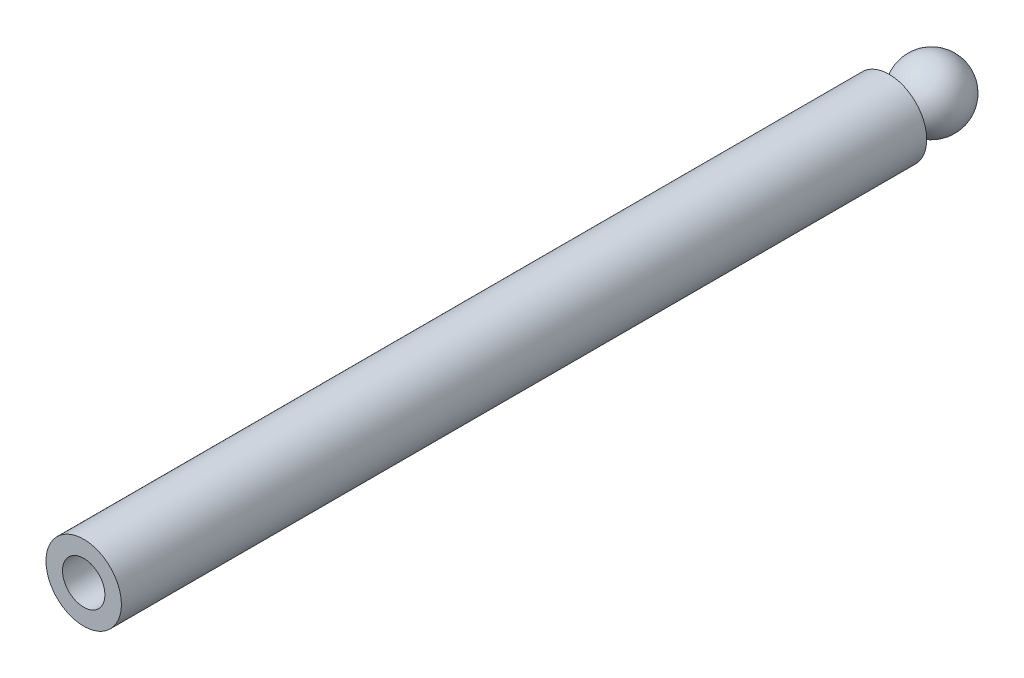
ISO-10303-21;
HEADER;
FILE_DESCRIPTION(('STEP AP214'),'2;1');
FILE_NAME('part.step','',(''),(''),'','','');
FILE_SCHEMA(('AUTOMOTIVE_DESIGN { 1 0 10303 214 1 1 1 1 }'));
ENDSEC;
DATA;
#1=APPLICATION_CONTEXT('core data for automotive mechanical design processes');
#2=APPLICATION_PROTOCOL_DEFINITION('international standard','automotive_design',2000,#1);
#3=PRODUCT_CONTEXT('',#1,'mechanical');
#4=PRODUCT('Part','Part','',(#3));
#5=PRODUCT_RELATED_PRODUCT_CATEGORY('part','',(#4));
#6=PRODUCT_DEFINITION_FORMATION('','',#4);
#7=PRODUCT_DEFINITION_CONTEXT('part definition',#1,'design');
#8=PRODUCT_DEFINITION('design','',#6,#7);
#9=PRODUCT_DEFINITION_SHAPE('','',#8);
#10=(LENGTH_UNIT() NAMED_UNIT(*) SI_UNIT(.MILLI.,.METRE.));
#11=(NAMED_UNIT(*) PLANE_ANGLE_UNIT() SI_UNIT($,.RADIAN.));
#12=(NAMED_UNIT(*) SI_UNIT($,.STERADIAN.) SOLID_ANGLE_UNIT());
#13=UNCERTAINTY_MEASURE_WITH_UNIT(LENGTH_MEASURE(1.E-05),#10,'distance_accuracy_value','');
#14=(GEOMETRIC_REPRESENTATION_CONTEXT(3) GLOBAL_UNCERTAINTY_ASSIGNED_CONTEXT((#13)) GLOBAL_UNIT_ASSIGNED_CONTEXT((#10,
#11,#12)) REPRESENTATION_CONTEXT('',''));
#15=CARTESIAN_POINT('',(0.,0.,0.));
#16=DIRECTION('',(0.,0.,1.));
#17=DIRECTION('',(1.,0.,0.));
#18=AXIS2_PLACEMENT_3D('',#15,#16,#17);
#19=CARTESIAN_POINT('',(0.,0.,0.));
#20=DIRECTION('',(0.,1.,0.));
#21=DIRECTION('',(1.,0.,0.));
#22=AXIS2_PLACEMENT_3D('',#19,#20,#21);
#23=SPHERICAL_SURFACE('',#22,35.);
#24=CARTESIAN_POINT('',(0.,0.,0.));
#25=DIRECTION('',(0.,0.,-1.));
#26=DIRECTION('',(-1.,0.,0.));
#27=AXIS2_PLACEMENT_3D('',#24,#25,#26);
#28=SPHERICAL_SURFACE('',#27,35.);
#29=CARTESIAN_POINT('',(0.,0.,33.5410196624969));
#30=DIRECTION('',(0.,0.,-1.));
#31=DIRECTION('',(-1.,0.,0.));
#32=AXIS2_PLACEMENT_3D('',#29,#30,#31);
#33=CIRCLE('',#32,10.);
#34=CARTESIAN_POINT('',(-10.,0.,33.5410196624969));
#35=VERTEX_POINT('',#34);
#36=EDGE_CURVE('E10',#35,#35,#33,.F.);
#37=ORIENTED_EDGE('',*,*,#36,.F.);
#38=EDGE_LOOP('',(#37));
#39=FACE_BOUND('',#38,.T.);
#40=ADVANCED_FACE('F31',(#39),#28,.T.);
#41=CARTESIAN_POINT('',(0.,0.,45.));
#42=DIRECTION('',(0.,0.,-1.));
#43=DIRECTION('',(-1.,0.,0.));
#44=AXIS2_PLACEMENT_3D('',#41,#42,#43);
#45=CYLINDRICAL_SURFACE('',#44,10.);
#46=CARTESIAN_POINT('',(0.,0.,45.));
#47=DIRECTION('',(0.,0.,1.));
#48=DIRECTION('',(1.,0.,0.));
#49=AXIS2_PLACEMENT_3D('',#46,#47,#48);
#50=CIRCLE('',#49,10.);
#51=CARTESIAN_POINT('',(-10.,0.,45.));
#52=VERTEX_POINT('',#51);
#53=EDGE_CURVE('E37',#52,#52,#50,.T.);
#54=CARTESIAN_POINT('',(-10.,0.,45.));
#55=CARTESIAN_POINT('',(-10.,0.,44.8806356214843));
#56=CARTESIAN_POINT('',(-10.,0.,44.7612712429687));
#57=CARTESIAN_POINT('',(-10.,0.,44.5225424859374));
#58=CARTESIAN_POINT('',(-10.,0.,44.4031781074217));
#59=CARTESIAN_POINT('',(-10.,0.,44.1644493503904));
#60=CARTESIAN_POINT('',(-10.,0.,44.0450849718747));
#61=CARTESIAN_POINT('',(-10.,0.,43.8063562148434));
#62=CARTESIAN_POINT('',(-10.,0.,43.6869918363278));
#63=CARTESIAN_POINT('',(-10.,0.,43.4482630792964));
#64=CARTESIAN_POINT('',(-10.,0.,43.3288987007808));
#65=CARTESIAN_POINT('',(-10.,0.,43.0901699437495));
#66=CARTESIAN_POINT('',(-10.,0.,42.9708055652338));
#67=CARTESIAN_POINT('',(-10.,0.,42.7320768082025));
#68=CARTESIAN_POINT('',(-10.,0.,42.6127124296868));
#69=CARTESIAN_POINT('',(-10.,0.,42.3739836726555));
#70=CARTESIAN_POINT('',(-10.,0.,42.2546192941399));
#71=CARTESIAN_POINT('',(-10.,0.,42.0158905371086));
#72=CARTESIAN_POINT('',(-10.,0.,41.8965261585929));
#73=CARTESIAN_POINT('',(-10.,0.,41.6577974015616));
#74=CARTESIAN_POINT('',(-10.,0.,41.5384330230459));
#75=CARTESIAN_POINT('',(-10.,0.,41.2997042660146));
#76=CARTESIAN_POINT('',(-10.,0.,41.180339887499));
#77=CARTESIAN_POINT('',(-10.,0.,40.9416111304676));
#78=CARTESIAN_POINT('',(-10.,0.,40.822246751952));
#79=CARTESIAN_POINT('',(-10.,0.,40.5835179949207));
#80=CARTESIAN_POINT('',(-10.,0.,40.464153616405));
#81=CARTESIAN_POINT('',(-10.,0.,40.2254248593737));
#82=CARTESIAN_POINT('',(-10.,0.,40.106060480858));
#83=CARTESIAN_POINT('',(-10.,0.,39.8673317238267));
#84=CARTESIAN_POINT('',(-10.,0.,39.7479673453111));
#85=CARTESIAN_POINT('',(-10.,0.,39.5092385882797));
#86=CARTESIAN_POINT('',(-10.,0.,39.3898742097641));
#87=CARTESIAN_POINT('',(-10.,0.,39.1511454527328));
#88=CARTESIAN_POINT('',(-10.,0.,39.0317810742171));
#89=CARTESIAN_POINT('',(-10.,0.,38.7930523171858));
#90=CARTESIAN_POINT('',(-10.,0.,38.6736879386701));
#91=CARTESIAN_POINT('',(-10.,0.,38.4349591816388));
#92=CARTESIAN_POINT('',(-10.,0.,38.3155948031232));
#93=CARTESIAN_POINT('',(-10.,0.,38.0768660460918));
#94=CARTESIAN_POINT('',(-10.,0.,37.9575016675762));
#95=CARTESIAN_POINT('',(-10.,0.,37.7187729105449));
#96=CARTESIAN_POINT('',(-10.,0.,37.5994085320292));
#97=CARTESIAN_POINT('',(-10.,0.,37.3606797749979));
#98=CARTESIAN_POINT('',(-10.,0.,37.2413153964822));
#99=CARTESIAN_POINT('',(-10.,0.,37.0025866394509));
#100=CARTESIAN_POINT('',(-10.,0.,36.8832222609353));
#101=CARTESIAN_POINT('',(-10.,0.,36.644493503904));
#102=CARTESIAN_POINT('',(-10.,0.,36.5251291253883));
#103=CARTESIAN_POINT('',(-10.,0.,36.286400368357));
#104=CARTESIAN_POINT('',(-10.,0.,36.1670359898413));
#105=CARTESIAN_POINT('',(-10.,0.,35.92830723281));
#106=CARTESIAN_POINT('',(-10.,0.,35.8089428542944));
#107=CARTESIAN_POINT('',(-10.,0.,35.570214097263));
#108=CARTESIAN_POINT('',(-10.,0.,35.4508497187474));
#109=CARTESIAN_POINT('',(-10.,0.,35.2121209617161));
#110=CARTESIAN_POINT('',(-10.,0.,35.0927565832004));
#111=CARTESIAN_POINT('',(-10.,0.,34.8540278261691));
#112=CARTESIAN_POINT('',(-10.,0.,34.7346634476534));
#113=CARTESIAN_POINT('',(-10.,0.,34.4959346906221));
#114=CARTESIAN_POINT('',(-10.,0.,34.3765703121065));
#115=CARTESIAN_POINT('',(-10.,0.,34.1378415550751));
#116=CARTESIAN_POINT('',(-10.,0.,34.0184771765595));
#117=CARTESIAN_POINT('',(-10.,0.,33.7797484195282));
#118=CARTESIAN_POINT('',(-10.,0.,33.6603840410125));
#119=CARTESIAN_POINT('',(-10.,0.,33.5410196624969));
#120=B_SPLINE_CURVE_WITH_KNOTS('',3,(#54,#55,#56,#57,#58,#59,#60,#61,#62,#63,#64,#65,#66,#67,
#68,#69,#70,#71,#72,#73,#74,#75,#76,#77,#78,#79,#80,#81,#82,#83,#84,#85,#86,#87,#88,#89,#90,#91,
#92,#93,#94,#95,#96,#97,#98,#99,#100,#101,#102,#103,#104,#105,#106,#107,#108,#109,#110,#111,
#112,#113,#114,#115,#116,#117,#118,#119),.UNSPECIFIED.,.F.,.F.,(4,2,2,2,2,2,2,2,2,2,2,2,2,2,2,2,
2,2,2,2,2,2,2,2,2,2,2,2,2,2,2,2,4),(0.,0.358093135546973,0.716186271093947,1.07427940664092,
1.43237254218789,1.79046567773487,2.14855881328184,2.50665194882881,2.86474508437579,
3.22283821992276,3.58093135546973,3.93902449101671,4.29711762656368,4.65521076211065,
5.01330389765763,5.3713970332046,5.72949016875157,6.08758330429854,6.44567643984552,
6.80376957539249,7.16186271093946,7.51995584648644,7.87804898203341,8.23614211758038,
8.59423525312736,8.95232838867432,9.3104215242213,9.66851465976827,10.0266077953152,
10.3847009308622,10.7427940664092,11.1008872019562,11.4589803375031),.UNSPECIFIED.);
#121=EDGE_CURVE('BSEAM79',#52,#35,#120,.T.);
#122=ORIENTED_EDGE('',*,*,#53,.F.);
#123=ORIENTED_EDGE('',*,*,#36,.T.);
#124=ORIENTED_EDGE('',*,*,#121,.T.);
#125=ORIENTED_EDGE('',*,*,#121,.F.);
#126=EDGE_LOOP('',(#122,#124,#123,#125));
#127=FACE_BOUND('',#126,.T.);
#128=ADVANCED_FACE('F79',(#127),#45,.T.);
#129=CARTESIAN_POINT('',(0.,0.,45.));
#130=DIRECTION('',(0.,0.,1.));
#131=DIRECTION('',(1.,0.,0.));
#132=AXIS2_PLACEMENT_3D('',#129,#130,#131);
#133=PLANE('',#132);
#134=CARTESIAN_POINT('',(0.,0.,45.));
#135=DIRECTION('',(0.,0.,1.));
#136=DIRECTION('',(1.,0.,0.));
#137=AXIS2_PLACEMENT_3D('',#134,#135,#136);
#138=CIRCLE('',#137,40.);
#139=CARTESIAN_POINT('',(-40.,0.,44.9999999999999));
#140=VERTEX_POINT('',#139);
#141=EDGE_CURVE('E45',#140,#140,#138,.T.);
#142=ORIENTED_EDGE('',*,*,#141,.F.);
#143=EDGE_LOOP('',(#142));
#144=FACE_BOUND('',#143,.T.);
#145=ORIENTED_EDGE('',*,*,#53,.T.);
#146=EDGE_LOOP('',(#145));
#147=FACE_BOUND('',#146,.T.);
#148=ADVANCED_FACE('F74',(#144,#147),#133,.F.);
#149=CARTESIAN_POINT('',(0.,0.,900.));
#150=DIRECTION('',(0.,0.,-1.));
#151=DIRECTION('',(-1.,0.,0.));
#152=AXIS2_PLACEMENT_3D('',#149,#150,#151);
#153=CYLINDRICAL_SURFACE('',#152,40.);
#154=CARTESIAN_POINT('',(0.,0.,900.));
#155=DIRECTION('',(0.,0.,1.));
#156=DIRECTION('',(1.,0.,0.));
#157=AXIS2_PLACEMENT_3D('',#154,#155,#156);
#158=CIRCLE('',#157,40.);
#159=CARTESIAN_POINT('',(-40.,0.,900.));
#160=VERTEX_POINT('',#159);
#161=EDGE_CURVE('E41',#160,#160,#158,.T.);
#162=CARTESIAN_POINT('',(-40.,0.,900.));
#163=CARTESIAN_POINT('',(-40.,0.,891.09375));
#164=CARTESIAN_POINT('',(-40.,0.,882.1875));
#165=CARTESIAN_POINT('',(-40.,0.,864.375));
#166=CARTESIAN_POINT('',(-40.,0.,855.46875));
#167=CARTESIAN_POINT('',(-40.,0.,837.65625));
#168=CARTESIAN_POINT('',(-40.,0.,828.75));
#169=CARTESIAN_POINT('',(-40.,0.,810.9375));
#170=CARTESIAN_POINT('',(-40.,0.,802.03125));
#171=CARTESIAN_POINT('',(-40.,0.,784.21875));
#172=CARTESIAN_POINT('',(-40.,0.,775.3125));
#173=CARTESIAN_POINT('',(-40.,0.,757.5));
#174=CARTESIAN_POINT('',(-40.,0.,748.59375));
#175=CARTESIAN_POINT('',(-40.,0.,730.78125));
#176=CARTESIAN_POINT('',(-40.,0.,721.875));
#177=CARTESIAN_POINT('',(-40.,0.,704.0625));
#178=CARTESIAN_POINT('',(-40.,0.,695.15625));
#179=CARTESIAN_POINT('',(-40.,0.,677.34375));
#180=CARTESIAN_POINT('',(-40.,0.,668.4375));
#181=CARTESIAN_POINT('',(-40.,0.,650.625));
#182=CARTESIAN_POINT('',(-40.,0.,641.71875));
#183=CARTESIAN_POINT('',(-40.,0.,623.90625));
#184=CARTESIAN_POINT('',(-40.,0.,615.));
#185=CARTESIAN_POINT('',(-40.,0.,597.1875));
#186=CARTESIAN_POINT('',(-40.,0.,588.28125));
#187=CARTESIAN_POINT('',(-40.,0.,570.46875));
#188=CARTESIAN_POINT('',(-40.,0.,561.5625));
#189=CARTESIAN_POINT('',(-40.,0.,543.75));
#190=CARTESIAN_POINT('',(-40.,0.,534.84375));
#191=CARTESIAN_POINT('',(-40.,0.,517.03125));
#192=CARTESIAN_POINT('',(-40.,0.,508.125));
#193=CARTESIAN_POINT('',(-40.,0.,490.3125));
#194=CARTESIAN_POINT('',(-40.,0.,481.40625));
#195=CARTESIAN_POINT('',(-40.,0.,463.59375));
#196=CARTESIAN_POINT('',(-40.,0.,454.6875));
#197=CARTESIAN_POINT('',(-40.,0.,436.875));
#198=CARTESIAN_POINT('',(-40.,0.,427.96875));
#199=CARTESIAN_POINT('',(-40.,0.,410.15625));
#200=CARTESIAN_POINT('',(-40.,0.,401.25));
#201=CARTESIAN_POINT('',(-40.,0.,383.4375));
#202=CARTESIAN_POINT('',(-40.,0.,374.53125));
#203=CARTESIAN_POINT('',(-40.,0.,356.71875));
#204=CARTESIAN_POINT('',(-40.,0.,347.8125));
#205=CARTESIAN_POINT('',(-40.,0.,330.));
#206=CARTESIAN_POINT('',(-40.,0.,321.09375));
#207=CARTESIAN_POINT('',(-40.,0.,303.28125));
#208=CARTESIAN_POINT('',(-40.,0.,294.375));
#209=CARTESIAN_POINT('',(-40.,0.,276.5625));
#210=CARTESIAN_POINT('',(-40.,0.,267.65625));
#211=CARTESIAN_POINT('',(-40.,0.,249.84375));
#212=CARTESIAN_POINT('',(-40.,0.,240.9375));
#213=CARTESIAN_POINT('',(-40.,0.,223.125));
#214=CARTESIAN_POINT('',(-40.,0.,214.21875));
#215=CARTESIAN_POINT('',(-40.,0.,196.40625));
#216=CARTESIAN_POINT('',(-40.,0.,187.5));
#217=CARTESIAN_POINT('',(-40.,0.,169.6875));
#218=CARTESIAN_POINT('',(-40.,0.,160.78125));
#219=CARTESIAN_POINT('',(-40.,0.,142.96875));
#220=CARTESIAN_POINT('',(-40.,0.,134.0625));
#221=CARTESIAN_POINT('',(-40.,0.,116.25));
#222=CARTESIAN_POINT('',(-40.,0.,107.34375));
#223=CARTESIAN_POINT('',(-40.,0.,89.53125));
#224=CARTESIAN_POINT('',(-40.,0.,80.6249999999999));
#225=CARTESIAN_POINT('',(-40.,0.,62.8124999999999));
#226=CARTESIAN_POINT('',(-40.,0.,53.9062499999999));
#227=CARTESIAN_POINT('',(-40.,0.,44.9999999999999));
#228=B_SPLINE_CURVE_WITH_KNOTS('',3,(#162,#163,#164,#165,#166,#167,#168,#169,#170,#171,#172,
#173,#174,#175,#176,#177,#178,#179,#180,#181,#182,#183,#184,#185,#186,#187,#188,#189,#190,#191,
#192,#193,#194,#195,#196,#197,#198,#199,#200,#201,#202,#203,#204,#205,#206,#207,#208,#209,#210,
#211,#212,#213,#214,#215,#216,#217,#218,#219,#220,#221,#222,#223,#224,#225,#226,#227),
.UNSPECIFIED.,.F.,.F.,(4,2,2,2,2,2,2,2,2,2,2,2,2,2,2,2,2,2,2,2,2,2,2,2,2,2,2,2,2,2,2,2,4),(0.,
26.7187499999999,53.4374999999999,80.1562499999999,106.875,133.59375,160.3125,187.03125,213.75,
240.46875,267.1875,293.90625,320.625,347.34375,374.0625,400.78125,427.5,454.21875,480.9375,
507.65625,534.375,561.09375,587.8125,614.53125,641.25,667.96875,694.6875,721.40625,748.125,
774.84375,801.5625,828.28125,855.),.UNSPECIFIED.);
#229=EDGE_CURVE('BSEAM68',#160,#140,#228,.T.);
#230=ORIENTED_EDGE('',*,*,#161,.F.);
#231=ORIENTED_EDGE('',*,*,#141,.T.);
#232=ORIENTED_EDGE('',*,*,#229,.T.);
#233=ORIENTED_EDGE('',*,*,#229,.F.);
#234=EDGE_LOOP('',(#230,#232,#231,#233));
#235=FACE_BOUND('',#234,.T.);
#236=ADVANCED_FACE('F68',(#235),#153,.T.);
#237=CARTESIAN_POINT('',(0.,0.,900.));
#238=DIRECTION('',(0.,0.,1.));
#239=DIRECTION('',(1.,0.,0.));
#240=AXIS2_PLACEMENT_3D('',#237,#238,#239);
#241=PLANE('',#240);
#242=CARTESIAN_POINT('',(0.,0.,900.));
#243=DIRECTION('',(0.,0.,1.));
#244=DIRECTION('',(1.,0.,0.));
#245=AXIS2_PLACEMENT_3D('',#242,#243,#244);
#246=CIRCLE('',#245,22.5);
#247=CARTESIAN_POINT('',(22.5,0.,900.));
#248=VERTEX_POINT('',#247);
#249=EDGE_CURVE('E51',#248,#248,#246,.T.);
#250=ORIENTED_EDGE('',*,*,#249,.F.);
#251=EDGE_LOOP('',(#250));
#252=FACE_BOUND('',#251,.T.);
#253=ORIENTED_EDGE('',*,*,#161,.T.);
#254=EDGE_LOOP('',(#253));
#255=FACE_BOUND('',#254,.T.);
#256=ADVANCED_FACE('F62',(#252,#255),#241,.T.);
#257=CARTESIAN_POINT('',(0.,0.,450.));
#258=DIRECTION('',(0.,0.,1.));
#259=DIRECTION('',(1.,0.,0.));
#260=AXIS2_PLACEMENT_3D('',#257,#258,#259);
#261=CYLINDRICAL_SURFACE('',#260,22.5);
#262=CARTESIAN_POINT('',(0.,0.,450.));
#263=DIRECTION('',(0.,0.,1.));
#264=DIRECTION('',(1.,0.,0.));
#265=AXIS2_PLACEMENT_3D('',#262,#263,#264);
#266=CIRCLE('',#265,22.5);
#267=CARTESIAN_POINT('',(22.5,0.,450.));
#268=VERTEX_POINT('',#267);
#269=EDGE_CURVE('E49',#268,#268,#266,.T.);
#270=ORIENTED_EDGE('',*,*,#269,.F.);
#271=EDGE_LOOP('',(#270));
#272=FACE_BOUND('',#271,.T.);
#273=ORIENTED_EDGE('',*,*,#249,.T.);
#274=EDGE_LOOP('',(#273));
#275=FACE_BOUND('',#274,.T.);
#276=ADVANCED_FACE('F59',(#272,#275),#261,.F.);
#277=CARTESIAN_POINT('',(0.,0.,450.));
#278=DIRECTION('',(0.,0.,1.));
#279=DIRECTION('',(1.,0.,0.));
#280=AXIS2_PLACEMENT_3D('',#277,#278,#279);
#281=PLANE('',#280);
#282=ORIENTED_EDGE('',*,*,#269,.T.);
#283=EDGE_LOOP('',(#282));
#284=FACE_BOUND('',#283,.T.);
#285=ADVANCED_FACE('F57',(#284),#281,.T.);
#286=CLOSED_SHELL('',(#40,#128,#148,#236,#256,#276,#285));
#287=MANIFOLD_SOLID_BREP('B2',#286);
#288=ADVANCED_BREP_SHAPE_REPRESENTATION('',(#18,#287),#14);
#289=SHAPE_DEFINITION_REPRESENTATION(#9,#288);
ENDSEC;
END-ISO-10303-21;
